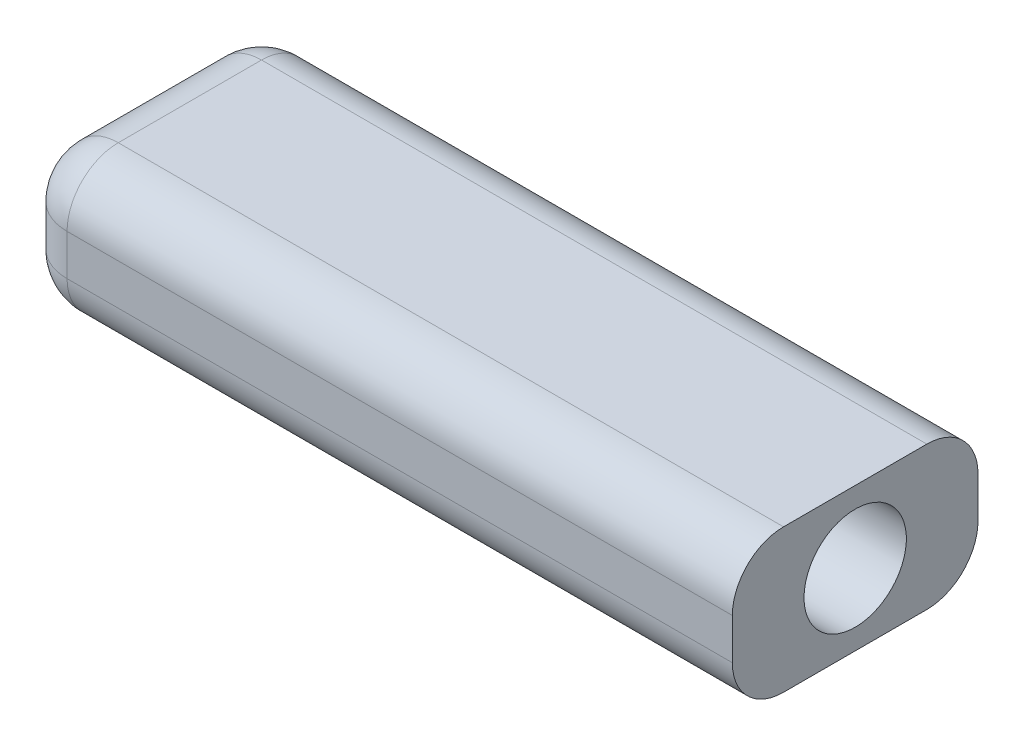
from build123d import *

# Parameters (mm, degrees)
SKETCH2_W           = 70
SKETCH2_H           = 24
BOSS_EXTRUDE1_DEPTH = 14
FILLET1_R           = 5
SKETCH3_R           = 5
CUT_EXTRUDE1_DEPTH  = 55


with BuildPart() as part:
    # Sketch2 → Boss-Extrude1 (new body)
    with BuildSketch(Plane(origin=(0, 0, 0), x_dir=(1, 0, 0), z_dir=(0, 1, 0))):
        Rectangle(SKETCH2_W, SKETCH2_H)
    extrude(amount=BOSS_EXTRUDE1_DEPTH)

    # Fillet1
    fillet1_edges = [part.edges().sort_by_distance(p)[0] for p in [
        (-35, 14, 0),
        (0, 14, 12),
        (0, 0, 12),
        (-35, 0, 0),
        (0, 0, -12),
        (0, 14, -12),
        (-35, 7, 12),
        (-35, 7, -12),
    ]]
    fillet(fillet1_edges, radius=FILLET1_R)

    # Sketch3 → Cut-Extrude1 (cut)
    with BuildSketch(Plane.ZY.offset(-35)):
        with Locations((0, 7)):
            Circle(SKETCH3_R)
    extrude(amount=CUT_EXTRUDE1_DEPTH, mode=Mode.SUBTRACT)


solid = part.part
